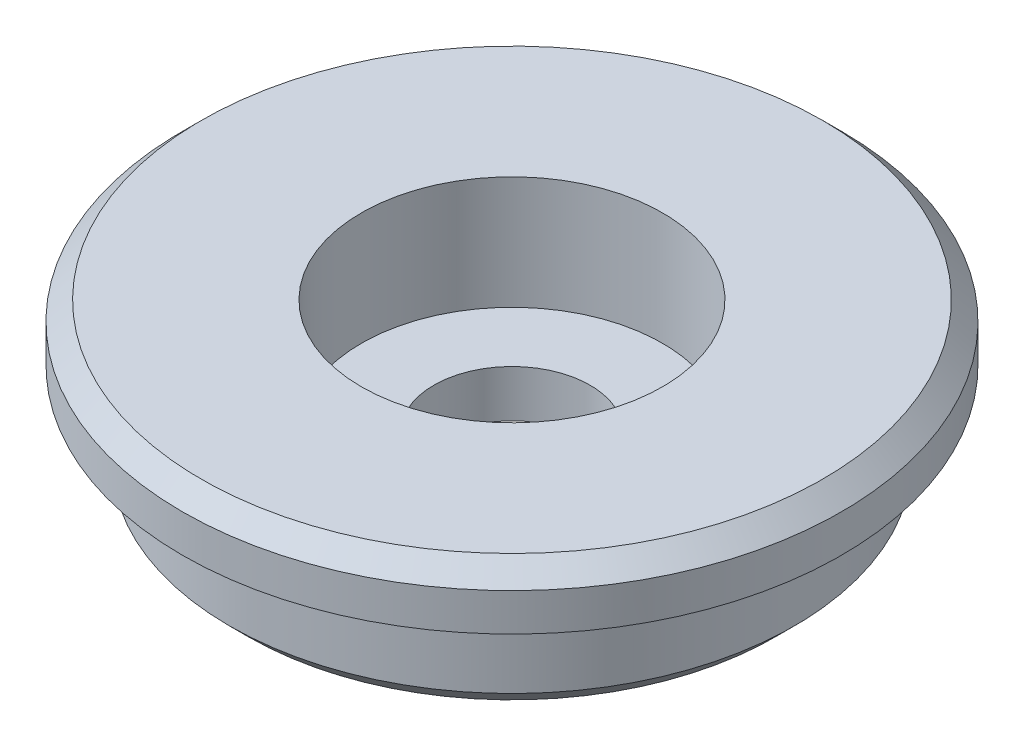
ISO-10303-21;
HEADER;
FILE_DESCRIPTION(('STEP AP214'),'2;1');
FILE_NAME('part.step','',(''),(''),'','','');
FILE_SCHEMA(('AUTOMOTIVE_DESIGN { 1 0 10303 214 1 1 1 1 }'));
ENDSEC;
DATA;
#1=APPLICATION_CONTEXT('core data for automotive mechanical design processes');
#2=APPLICATION_PROTOCOL_DEFINITION('international standard','automotive_design',2000,#1);
#3=PRODUCT_CONTEXT('',#1,'mechanical');
#4=PRODUCT('Part','Part','',(#3));
#5=PRODUCT_RELATED_PRODUCT_CATEGORY('part','',(#4));
#6=PRODUCT_DEFINITION_FORMATION('','',#4);
#7=PRODUCT_DEFINITION_CONTEXT('part definition',#1,'design');
#8=PRODUCT_DEFINITION('design','',#6,#7);
#9=PRODUCT_DEFINITION_SHAPE('','',#8);
#10=(LENGTH_UNIT() NAMED_UNIT(*) SI_UNIT(.MILLI.,.METRE.));
#11=(NAMED_UNIT(*) PLANE_ANGLE_UNIT() SI_UNIT($,.RADIAN.));
#12=(NAMED_UNIT(*) SI_UNIT($,.STERADIAN.) SOLID_ANGLE_UNIT());
#13=UNCERTAINTY_MEASURE_WITH_UNIT(LENGTH_MEASURE(1.E-05),#10,'distance_accuracy_value','');
#14=(GEOMETRIC_REPRESENTATION_CONTEXT(3) GLOBAL_UNCERTAINTY_ASSIGNED_CONTEXT((#13)) GLOBAL_UNIT_ASSIGNED_CONTEXT((#10,
#11,#12)) REPRESENTATION_CONTEXT('',''));
#15=CARTESIAN_POINT('',(0.,0.,0.));
#16=DIRECTION('',(0.,0.,1.));
#17=DIRECTION('',(1.,0.,0.));
#18=AXIS2_PLACEMENT_3D('',#15,#16,#17);
#19=CARTESIAN_POINT('',(8.,8.5,0.));
#20=DIRECTION('',(0.,-1.,0.));
#21=DIRECTION('',(0.,0.,-1.));
#22=AXIS2_PLACEMENT_3D('',#19,#20,#21);
#23=PLANE('',#22);
#24=CARTESIAN_POINT('',(0.,8.5,0.));
#25=DIRECTION('',(0.,-1.,0.));
#26=DIRECTION('',(0.,0.,-1.));
#27=AXIS2_PLACEMENT_3D('',#24,#25,#26);
#28=CIRCLE('',#27,16.5);
#29=CARTESIAN_POINT('',(0.,8.5,-16.5));
#30=VERTEX_POINT('',#29);
#31=EDGE_CURVE('E38',#30,#30,#28,.F.);
#32=ORIENTED_EDGE('',*,*,#31,.T.);
#33=EDGE_LOOP('',(#32));
#34=FACE_BOUND('',#33,.T.);
#35=CARTESIAN_POINT('',(0.,8.5,0.));
#36=DIRECTION('',(0.,1.,0.));
#37=DIRECTION('',(0.,0.,1.));
#38=AXIS2_PLACEMENT_3D('',#35,#36,#37);
#39=CIRCLE('',#38,8.);
#40=CARTESIAN_POINT('',(0.,8.5,8.));
#41=VERTEX_POINT('',#40);
#42=EDGE_CURVE('E69',#41,#41,#39,.T.);
#43=ORIENTED_EDGE('',*,*,#42,.F.);
#44=EDGE_LOOP('',(#43));
#45=FACE_BOUND('',#44,.T.);
#46=ADVANCED_FACE('F32',(#34,#45),#23,.F.);
#47=CARTESIAN_POINT('',(0.,34.1445530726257,0.));
#48=DIRECTION('',(0.,1.,0.));
#49=DIRECTION('',(0.,0.,1.));
#50=AXIS2_PLACEMENT_3D('',#47,#48,#49);
#51=CYLINDRICAL_SURFACE('',#50,17.5);
#52=CARTESIAN_POINT('',(0.,7.5,0.));
#53=DIRECTION('',(0.,-1.,0.));
#54=DIRECTION('',(0.,0.,-1.));
#55=AXIS2_PLACEMENT_3D('',#52,#53,#54);
#56=CIRCLE('',#55,17.5);
#57=CARTESIAN_POINT('',(0.,7.5,-17.5));
#58=VERTEX_POINT('',#57);
#59=EDGE_CURVE('E10',#58,#58,#56,.T.);
#60=ORIENTED_EDGE('',*,*,#59,.T.);
#61=EDGE_LOOP('',(#60));
#62=FACE_BOUND('',#61,.T.);
#63=CARTESIAN_POINT('',(0.,5.5,0.));
#64=DIRECTION('',(0.,1.,0.));
#65=DIRECTION('',(0.,0.,1.));
#66=AXIS2_PLACEMENT_3D('',#63,#64,#65);
#67=CIRCLE('',#66,17.5);
#68=CARTESIAN_POINT('',(0.,5.5,17.5));
#69=VERTEX_POINT('',#68);
#70=EDGE_CURVE('E57',#69,#69,#67,.T.);
#71=ORIENTED_EDGE('',*,*,#70,.T.);
#72=EDGE_LOOP('',(#71));
#73=FACE_BOUND('',#72,.T.);
#74=ADVANCED_FACE('F76',(#62,#73),#51,.T.);
#75=CARTESIAN_POINT('',(17.5,5.5,0.));
#76=DIRECTION('',(0.,1.,0.));
#77=DIRECTION('',(0.,0.,1.));
#78=AXIS2_PLACEMENT_3D('',#75,#76,#77);
#79=PLANE('',#78);
#80=CARTESIAN_POINT('',(0.,5.5,0.));
#81=DIRECTION('',(0.,1.,0.));
#82=DIRECTION('',(0.,0.,1.));
#83=AXIS2_PLACEMENT_3D('',#80,#81,#82);
#84=CIRCLE('',#83,15.5);
#85=CARTESIAN_POINT('',(0.,5.5,15.5));
#86=VERTEX_POINT('',#85);
#87=EDGE_CURVE('E54',#86,#86,#84,.T.);
#88=ORIENTED_EDGE('',*,*,#87,.T.);
#89=EDGE_LOOP('',(#88));
#90=FACE_BOUND('',#89,.T.);
#91=ORIENTED_EDGE('',*,*,#70,.F.);
#92=EDGE_LOOP('',(#91));
#93=FACE_BOUND('',#92,.T.);
#94=ADVANCED_FACE('F80',(#90,#93),#79,.F.);
#95=CARTESIAN_POINT('',(0.,34.1445530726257,0.));
#96=DIRECTION('',(0.,1.,0.));
#97=DIRECTION('',(0.,0.,1.));
#98=AXIS2_PLACEMENT_3D('',#95,#96,#97);
#99=CYLINDRICAL_SURFACE('',#98,15.);
#100=CARTESIAN_POINT('',(0.,1.,0.));
#101=DIRECTION('',(0.,1.,0.));
#102=DIRECTION('',(0.,0.,1.));
#103=AXIS2_PLACEMENT_3D('',#100,#101,#102);
#104=CIRCLE('',#103,15.);
#105=CARTESIAN_POINT('',(0.,1.,15.));
#106=VERTEX_POINT('',#105);
#107=EDGE_CURVE('E46',#106,#106,#104,.T.);
#108=ORIENTED_EDGE('',*,*,#107,.T.);
#109=EDGE_LOOP('',(#108));
#110=FACE_BOUND('',#109,.T.);
#111=CARTESIAN_POINT('',(0.,5.,0.));
#112=DIRECTION('',(0.,1.,0.));
#113=DIRECTION('',(0.,0.,1.));
#114=AXIS2_PLACEMENT_3D('',#111,#112,#113);
#115=CIRCLE('',#114,15.);
#116=CARTESIAN_POINT('',(0.,5.,15.));
#117=VERTEX_POINT('',#116);
#118=EDGE_CURVE('E51',#117,#117,#115,.F.);
#119=ORIENTED_EDGE('',*,*,#118,.T.);
#120=EDGE_LOOP('',(#119));
#121=FACE_BOUND('',#120,.T.);
#122=ADVANCED_FACE('F84',(#110,#121),#99,.T.);
#123=CARTESIAN_POINT('',(15.,0.,0.));
#124=DIRECTION('',(0.,1.,0.));
#125=DIRECTION('',(0.,0.,1.));
#126=AXIS2_PLACEMENT_3D('',#123,#124,#125);
#127=PLANE('',#126);
#128=CARTESIAN_POINT('',(0.,0.,0.));
#129=DIRECTION('',(0.,1.,0.));
#130=DIRECTION('',(0.,0.,1.));
#131=AXIS2_PLACEMENT_3D('',#128,#129,#130);
#132=CIRCLE('',#131,14.);
#133=CARTESIAN_POINT('',(0.,0.,14.));
#134=VERTEX_POINT('',#133);
#135=EDGE_CURVE('E42',#134,#134,#132,.F.);
#136=ORIENTED_EDGE('',*,*,#135,.T.);
#137=EDGE_LOOP('',(#136));
#138=FACE_BOUND('',#137,.T.);
#139=CARTESIAN_POINT('',(0.,0.,0.));
#140=DIRECTION('',(0.,1.,0.));
#141=DIRECTION('',(0.,0.,1.));
#142=AXIS2_PLACEMENT_3D('',#139,#140,#141);
#143=CIRCLE('',#142,4.15);
#144=CARTESIAN_POINT('',(0.,0.,4.15));
#145=VERTEX_POINT('',#144);
#146=EDGE_CURVE('E60',#145,#145,#143,.T.);
#147=ORIENTED_EDGE('',*,*,#146,.T.);
#148=EDGE_LOOP('',(#147));
#149=FACE_BOUND('',#148,.T.);
#150=ADVANCED_FACE('F91',(#138,#149),#127,.F.);
#151=CARTESIAN_POINT('',(0.,34.1445530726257,0.));
#152=DIRECTION('',(0.,1.,0.));
#153=DIRECTION('',(0.,0.,1.));
#154=AXIS2_PLACEMENT_3D('',#151,#152,#153);
#155=CYLINDRICAL_SURFACE('',#154,4.15);
#156=ORIENTED_EDGE('',*,*,#146,.F.);
#157=EDGE_LOOP('',(#156));
#158=FACE_BOUND('',#157,.T.);
#159=CARTESIAN_POINT('',(0.,2.5,0.));
#160=DIRECTION('',(0.,1.,0.));
#161=DIRECTION('',(0.,0.,1.));
#162=AXIS2_PLACEMENT_3D('',#159,#160,#161);
#163=CIRCLE('',#162,4.15);
#164=CARTESIAN_POINT('',(0.,2.5,4.15));
#165=VERTEX_POINT('',#164);
#166=EDGE_CURVE('E63',#165,#165,#163,.T.);
#167=ORIENTED_EDGE('',*,*,#166,.T.);
#168=EDGE_LOOP('',(#167));
#169=FACE_BOUND('',#168,.T.);
#170=ADVANCED_FACE('F95',(#158,#169),#155,.F.);
#171=CARTESIAN_POINT('',(4.15,2.5,0.));
#172=DIRECTION('',(0.,-1.,0.));
#173=DIRECTION('',(0.,0.,-1.));
#174=AXIS2_PLACEMENT_3D('',#171,#172,#173);
#175=PLANE('',#174);
#176=ORIENTED_EDGE('',*,*,#166,.F.);
#177=EDGE_LOOP('',(#176));
#178=FACE_BOUND('',#177,.T.);
#179=CARTESIAN_POINT('',(0.,2.5,0.));
#180=DIRECTION('',(0.,1.,0.));
#181=DIRECTION('',(0.,0.,1.));
#182=AXIS2_PLACEMENT_3D('',#179,#180,#181);
#183=CIRCLE('',#182,8.);
#184=CARTESIAN_POINT('',(0.,2.5,8.));
#185=VERTEX_POINT('',#184);
#186=EDGE_CURVE('E66',#185,#185,#183,.T.);
#187=ORIENTED_EDGE('',*,*,#186,.T.);
#188=EDGE_LOOP('',(#187));
#189=FACE_BOUND('',#188,.T.);
#190=ADVANCED_FACE('F99',(#178,#189),#175,.F.);
#191=CARTESIAN_POINT('',(0.,34.1445530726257,0.));
#192=DIRECTION('',(0.,1.,0.));
#193=DIRECTION('',(0.,0.,1.));
#194=AXIS2_PLACEMENT_3D('',#191,#192,#193);
#195=CYLINDRICAL_SURFACE('',#194,8.);
#196=ORIENTED_EDGE('',*,*,#186,.F.);
#197=EDGE_LOOP('',(#196));
#198=FACE_BOUND('',#197,.T.);
#199=ORIENTED_EDGE('',*,*,#42,.T.);
#200=EDGE_LOOP('',(#199));
#201=FACE_BOUND('',#200,.T.);
#202=ADVANCED_FACE('F73',(#198,#201),#195,.F.);
#203=CARTESIAN_POINT('',(0.,5.,0.));
#204=DIRECTION('',(0.,1.,0.));
#205=DIRECTION('',(0.,0.,1.));
#206=AXIS2_PLACEMENT_3D('',#203,#204,#205);
#207=TOROIDAL_SURFACE('',#206,15.5,0.5);
#208=ORIENTED_EDGE('',*,*,#118,.F.);
#209=EDGE_LOOP('',(#208));
#210=FACE_BOUND('',#209,.T.);
#211=ORIENTED_EDGE('',*,*,#87,.F.);
#212=EDGE_LOOP('',(#211));
#213=FACE_BOUND('',#212,.T.);
#214=ADVANCED_FACE('F106',(#210,#213),#207,.F.);
#215=CARTESIAN_POINT('',(0.,1.,0.));
#216=DIRECTION('',(0.,1.,0.));
#217=DIRECTION('',(0.,0.,1.));
#218=AXIS2_PLACEMENT_3D('',#215,#216,#217);
#219=CONICAL_SURFACE('',#218,15.,0.785398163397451);
#220=ORIENTED_EDGE('',*,*,#135,.F.);
#221=EDGE_LOOP('',(#220));
#222=FACE_BOUND('',#221,.T.);
#223=ORIENTED_EDGE('',*,*,#107,.F.);
#224=EDGE_LOOP('',(#223));
#225=FACE_BOUND('',#224,.T.);
#226=ADVANCED_FACE('F110',(#222,#225),#219,.T.);
#227=CARTESIAN_POINT('',(0.,8.5,0.));
#228=DIRECTION('',(0.,-1.,0.));
#229=DIRECTION('',(0.,0.,-1.));
#230=AXIS2_PLACEMENT_3D('',#227,#228,#229);
#231=CONICAL_SURFACE('',#230,16.5,0.785398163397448);
#232=ORIENTED_EDGE('',*,*,#59,.F.);
#233=EDGE_LOOP('',(#232));
#234=FACE_BOUND('',#233,.T.);
#235=ORIENTED_EDGE('',*,*,#31,.F.);
#236=EDGE_LOOP('',(#235));
#237=FACE_BOUND('',#236,.T.);
#238=ADVANCED_FACE('F114',(#234,#237),#231,.T.);
#239=CLOSED_SHELL('',(#46,#74,#94,#122,#150,#170,#190,#202,#214,#226,#238));
#240=MANIFOLD_SOLID_BREP('B2',#239);
#241=ADVANCED_BREP_SHAPE_REPRESENTATION('',(#18,#240),#14);
#242=SHAPE_DEFINITION_REPRESENTATION(#9,#241);
ENDSEC;
END-ISO-10303-21;
